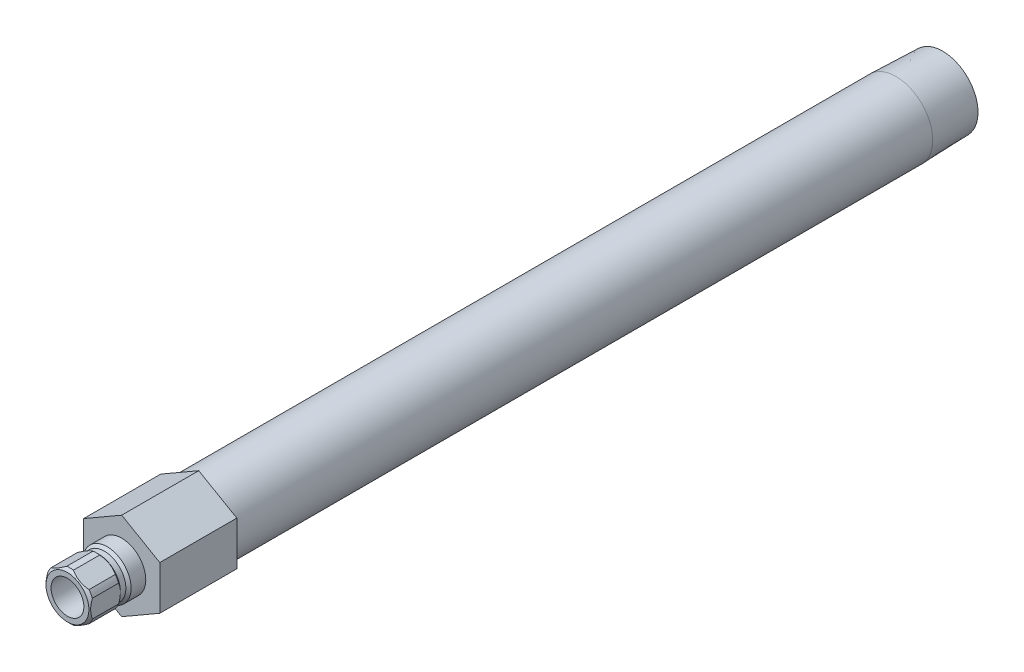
from build123d import *

# Parameters (mm, degrees)
SKETCH2_R           = 4.7625
BOSS_EXTRUDE1_DEPTH = 22.352
CUT_EXTRUDE1_START  = 6.604
SKETCH3_OUTSIDE_W   = 75.344
SKETCH3_OUTSIDE_H   = 78.762
CUT_EXTRUDE1_DEPTH  = 233.245052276


with BuildPart() as part:
    # Sketch1 → Revolve1 (revolve)
    with BuildSketch(Plane(origin=(0, 0, 0), x_dir=(0, 0, -1), z_dir=(1, 0, 0))):
        Polygon((-15.748, 4.7625), (-15.748, 6.223), (-14.986, 6.985), (-7.366, 6.985), (-6.604, 6.223), (-5.0165, 6.223), (-4.2545, 6.985), (0, 6.985), (0, 10.668), (224.6884, 10.668), (238.252, 10.244140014), (238.252, 7.8994), (22.352, 7.8994), (22.352, 4.7625), align=None)
    revolve(axis=Axis((0, 0, 13.122373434), (0, 0, 1)))

    # Sketch2 → Boss-Extrude1 (add)
    with BuildSketch(Plane.XY):
        Polygon((-11.049, 6.379143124), (-11.049, -6.379143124), (0, -12.758286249), (11.049, -6.379143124), (11.049, 6.379143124), (0, 12.758286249), align=None)
        with Locations(Location((0, 0, 0), (0, 0, 90))):
            Circle(SKETCH2_R, mode=Mode.SUBTRACT)
    extrude(amount=-BOSS_EXTRUDE1_DEPTH)

    # Sketch3 outside → Cut-Extrude1 (cut, through all)
    with BuildSketch(Plane.XY.offset(CUT_EXTRUDE1_START)):
        Rectangle(SKETCH3_OUTSIDE_W, SKETCH3_OUTSIDE_H)
        Polygon((6.477, -3.739497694), (6.477, 3.739497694), (0, 7.478995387), (-6.477, 3.739497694), (-6.477, -3.739497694), (0, -7.478995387), align=None, mode=Mode.SUBTRACT)
    extrude(amount=CUT_EXTRUDE1_DEPTH, mode=Mode.SUBTRACT)


solid = part.part
